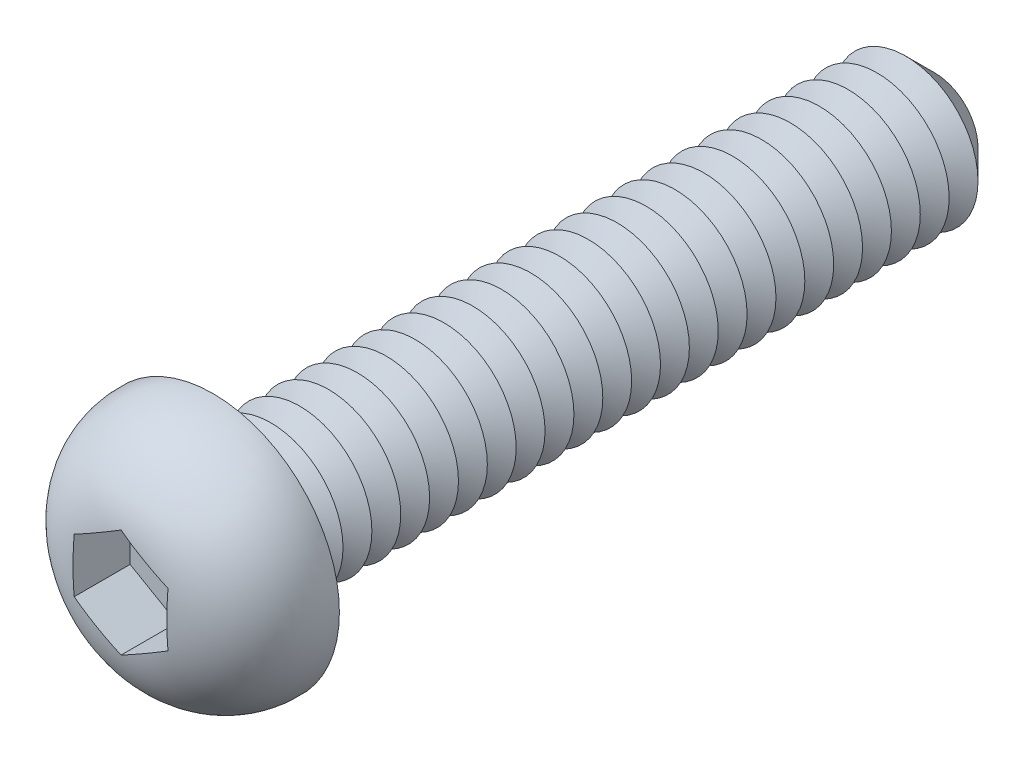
from build123d import *

# Parameters (mm, degrees)
CUT_EXTRUDE1_DEPTH  = 0.8
SKETCH4_R           = 1
BOSS_EXTRUDE1_DEPTH = 10
CHAMFER1_SIZE       = 0.4
LPATTERN1_COUNT     = 23
LPATTERN1_PITCH     = 0.4
FILLET2_R           = 0.2
SKETCH6_R           = 0.35
CUT_EXTRUDE2_DEPTH  = 10.5


with BuildPart() as part:
    # Sketch2 → Revolve1 (revolve)
    with BuildSketch(Plane(origin=(0, 0, 0), x_dir=(0, 0, -1), z_dir=(1, 0, 0)), mode=Mode.PRIVATE) as revolve1_sk:
        with BuildLine():
            Line((0, 0), (-1.3, 0))
            Line((-1.3, 0), (-1.3, 0.5010004))
            ThreePointArc((-1.3, 0.5010004), (-0.916025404, 1.402388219), (0, 1.75))
            Line((0, 1.75), (0, 0))
        make_face()
    revolve(revolve1_sk.sketch.rotate(Axis((0, 0, 47.934239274), (0, 0, -1)), 90), axis=Axis((0, 0, 47.934239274), (0, 0, -1)))

    # Sketch3 → Cut-Extrude1 (cut)
    with BuildSketch(Plane.XY.offset(1.3)):
        Polygon((0, 0.75055535), (-0.65, 0.375277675), (-0.65, -0.375277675), (0, -0.75055535), (0.65, -0.375277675), (0.65, 0.375277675), align=None)
    extrude(amount=-CUT_EXTRUDE1_DEPTH, mode=Mode.SUBTRACT)

    # Sketch4 → Boss-Extrude1 (add)
    with BuildSketch(Plane(origin=(0, 0, 0), x_dir=(-1, 0, 0), z_dir=(0, 0, -1))):
        Circle(SKETCH4_R)
    extrude(amount=BOSS_EXTRUDE1_DEPTH)

    # Chamfer1
    chamfer1_edges = [part.edges().sort_by_distance(p)[0] for p in [
        (1, 0, -10),
    ]]
    chamfer(chamfer1_edges, length=CHAMFER1_SIZE)

    # Sketch5 → Cut-Revolve1 (revolve, cut)
    with BuildSketch(Plane(origin=(0, 0, 0), x_dir=(0, 0, -1), z_dir=(1, 0, 0)), mode=Mode.PRIVATE) as cut_revolve1_sk:
        Polygon((0.4, 1), (0.8, 1), (0.6, 0.653589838), align=None)
    cut_revolve1 = revolve(cut_revolve1_sk.sketch.rotate(Axis((0, 0, 47.934239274), (0, 0, -1)), 90), axis=Axis((0, 0, 47.934239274), (0, 0, -1)), mode=Mode.SUBTRACT)

    # LPattern1: Cut-Revolve1 ×23
    with Locations(*[(0, 0, -i * LPATTERN1_PITCH) for i in range(1, LPATTERN1_COUNT)]):
        add(cut_revolve1, mode=Mode.SUBTRACT)

    # Fillet2
    fillet2_edges = [part.edges().sort_by_distance(p)[0] for p in [
        (1, 0, 0),
    ]]
    fillet(fillet2_edges, radius=FILLET2_R)

    # Sketch6 → Cut-Extrude2 (cut)
    with BuildSketch(Plane.XY.offset(0.5)):
        Circle(SKETCH6_R)
    extrude(amount=-CUT_EXTRUDE2_DEPTH, mode=Mode.SUBTRACT)


solid = part.part
